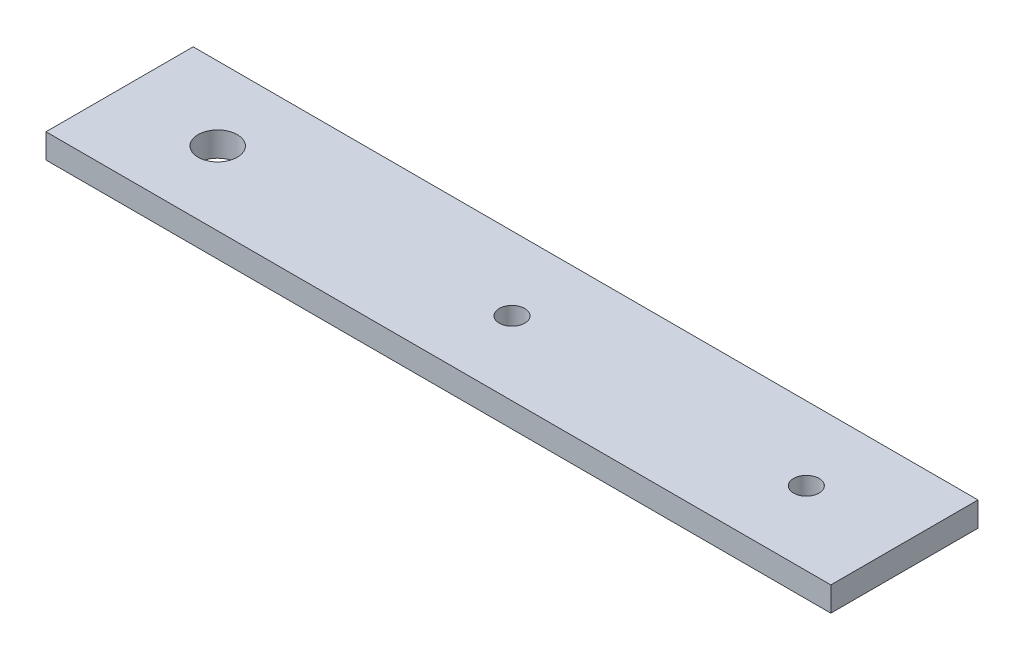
from build123d import *

# Parameters (mm, degrees)
SKETCH1_W          = 101.6
SKETCH1_H          = 19.05
SKETCH1_R          = 2.54
SKETCH1_R_2        = 1.651
BASE_EXTRUDE_DEPTH = 3.175


with BuildPart() as part:
    # Sketch1 → Base-Extrude (new body)
    with BuildSketch(Plane(origin=(0, 0, 0), x_dir=(1, 0, 0), z_dir=(0, 1, 0))):
        with Locations((50.8, 9.525)):
            Rectangle(SKETCH1_W, SKETCH1_H)
        with Locations(Location((12.7, 9.525, 0), (0, 0, 270))):
            Circle(SKETCH1_R, mode=Mode.SUBTRACT)
        with Locations(Location((50.8, 9.525, 0), (0, 0, 270))):
            Circle(SKETCH1_R_2, mode=Mode.SUBTRACT)
        with Locations(Location((88.9, 9.525, 0), (0, 0, 270))):
            Circle(SKETCH1_R_2, mode=Mode.SUBTRACT)
    extrude(amount=BASE_EXTRUDE_DEPTH)


solid = part.part
